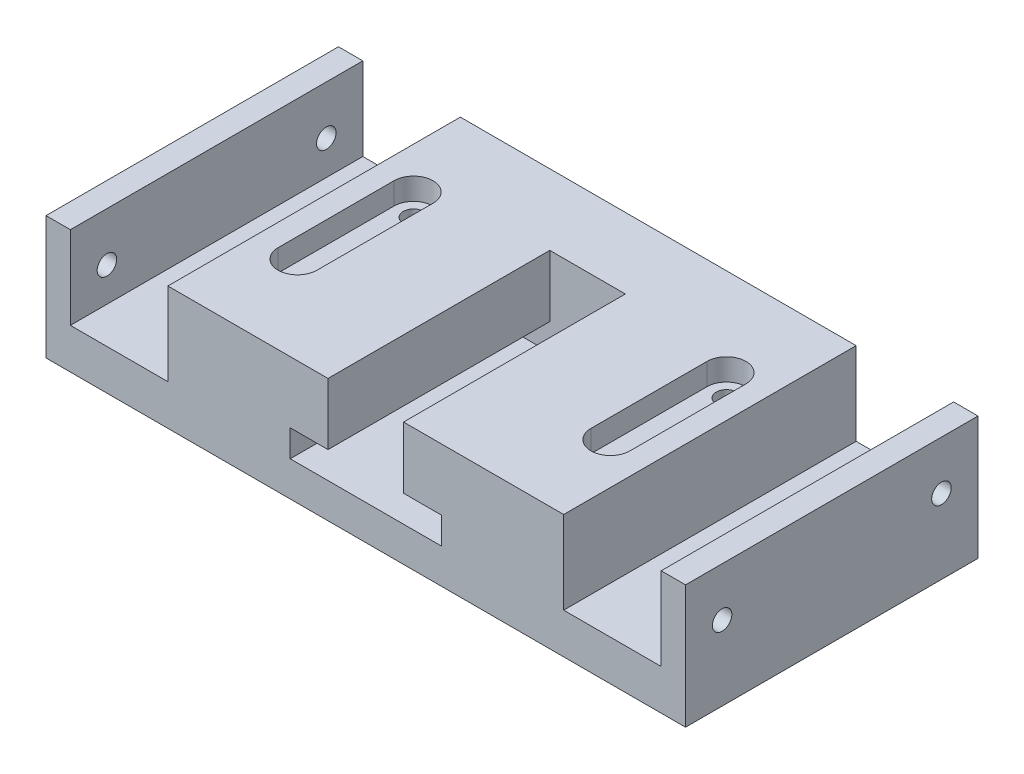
ISO-10303-21;
HEADER;
FILE_DESCRIPTION(('STEP AP214'),'2;1');
FILE_NAME('part.step','',(''),(''),'','','');
FILE_SCHEMA(('AUTOMOTIVE_DESIGN { 1 0 10303 214 1 1 1 1 }'));
ENDSEC;
DATA;
#1=APPLICATION_CONTEXT('core data for automotive mechanical design processes');
#2=APPLICATION_PROTOCOL_DEFINITION('international standard','automotive_design',2000,#1);
#3=PRODUCT_CONTEXT('',#1,'mechanical');
#4=PRODUCT('Part','Part','',(#3));
#5=PRODUCT_RELATED_PRODUCT_CATEGORY('part','',(#4));
#6=PRODUCT_DEFINITION_FORMATION('','',#4);
#7=PRODUCT_DEFINITION_CONTEXT('part definition',#1,'design');
#8=PRODUCT_DEFINITION('design','',#6,#7);
#9=PRODUCT_DEFINITION_SHAPE('','',#8);
#10=(LENGTH_UNIT() NAMED_UNIT(*) SI_UNIT(.MILLI.,.METRE.));
#11=(NAMED_UNIT(*) PLANE_ANGLE_UNIT() SI_UNIT($,.RADIAN.));
#12=(NAMED_UNIT(*) SI_UNIT($,.STERADIAN.) SOLID_ANGLE_UNIT());
#13=UNCERTAINTY_MEASURE_WITH_UNIT(LENGTH_MEASURE(1.E-05),#10,'distance_accuracy_value','');
#14=(GEOMETRIC_REPRESENTATION_CONTEXT(3) GLOBAL_UNCERTAINTY_ASSIGNED_CONTEXT((#13)) GLOBAL_UNIT_ASSIGNED_CONTEXT((#10,
#11,#12)) REPRESENTATION_CONTEXT('',''));
#15=CARTESIAN_POINT('',(0.,0.,0.));
#16=DIRECTION('',(0.,0.,1.));
#17=DIRECTION('',(1.,0.,0.));
#18=AXIS2_PLACEMENT_3D('',#15,#16,#17);
#19=CARTESIAN_POINT('',(-65.6,12.65,60.));
#20=DIRECTION('',(0.,-1.,0.));
#21=DIRECTION('',(0.,0.,-1.));
#22=AXIS2_PLACEMENT_3D('',#19,#20,#21);
#23=PLANE('',#22);
#24=DIRECTION('',(0.,0.,-1.));
#25=VECTOR('',#24,1.);
#26=CARTESIAN_POINT('',(-28.1,12.65,41.9));
#27=LINE('',#26,#25);
#28=CARTESIAN_POINT('',(-28.1,12.65,41.9));
#29=VERTEX_POINT('',#28);
#30=CARTESIAN_POINT('',(-28.1,12.65,18.1));
#31=VERTEX_POINT('',#30);
#32=EDGE_CURVE('E547',#29,#31,#27,.T.);
#33=ORIENTED_EDGE('',*,*,#32,.F.);
#34=CARTESIAN_POINT('',(-32.1,12.65,41.9));
#35=DIRECTION('',(0.,1.,0.));
#36=DIRECTION('',(0.,0.,1.));
#37=AXIS2_PLACEMENT_3D('',#34,#35,#36);
#38=CIRCLE('',#37,4.);
#39=CARTESIAN_POINT('',(-36.1,12.65,41.9));
#40=VERTEX_POINT('',#39);
#41=EDGE_CURVE('E372',#40,#29,#38,.T.);
#42=ORIENTED_EDGE('',*,*,#41,.F.);
#43=DIRECTION('',(0.,0.,1.));
#44=VECTOR('',#43,1.);
#45=CARTESIAN_POINT('',(-36.1,12.65,18.1));
#46=LINE('',#45,#44);
#47=CARTESIAN_POINT('',(-36.1,12.65,18.1));
#48=VERTEX_POINT('',#47);
#49=EDGE_CURVE('E331',#48,#40,#46,.T.);
#50=ORIENTED_EDGE('',*,*,#49,.F.);
#51=CARTESIAN_POINT('',(-32.1,12.65,18.1));
#52=DIRECTION('',(0.,1.,0.));
#53=DIRECTION('',(0.,0.,1.));
#54=AXIS2_PLACEMENT_3D('',#51,#52,#53);
#55=CIRCLE('',#54,4.);
#56=EDGE_CURVE('E550',#31,#48,#55,.T.);
#57=ORIENTED_EDGE('',*,*,#56,.F.);
#58=EDGE_LOOP('',(#33,#42,#50,#57));
#59=FACE_BOUND('',#58,.T.);
#60=DIRECTION('',(0.,0.,1.));
#61=VECTOR('',#60,1.);
#62=CARTESIAN_POINT('',(28.1,12.65,41.9));
#63=LINE('',#62,#61);
#64=CARTESIAN_POINT('',(28.1,12.65,18.1));
#65=VERTEX_POINT('',#64);
#66=CARTESIAN_POINT('',(28.1,12.65,41.9));
#67=VERTEX_POINT('',#66);
#68=EDGE_CURVE('E365',#65,#67,#63,.T.);
#69=ORIENTED_EDGE('',*,*,#68,.F.);
#70=CARTESIAN_POINT('',(32.1,12.65,18.1));
#71=DIRECTION('',(0.,1.,0.));
#72=DIRECTION('',(0.,0.,-1.));
#73=AXIS2_PLACEMENT_3D('',#70,#71,#72);
#74=CIRCLE('',#73,4.);
#75=CARTESIAN_POINT('',(36.1,12.65,18.1));
#76=VERTEX_POINT('',#75);
#77=EDGE_CURVE('E369',#76,#65,#74,.T.);
#78=ORIENTED_EDGE('',*,*,#77,.F.);
#79=DIRECTION('',(0.,0.,-1.));
#80=VECTOR('',#79,1.);
#81=CARTESIAN_POINT('',(36.1,12.65,18.1));
#82=LINE('',#81,#80);
#83=CARTESIAN_POINT('',(36.1,12.65,41.9));
#84=VERTEX_POINT('',#83);
#85=EDGE_CURVE('E356',#84,#76,#82,.T.);
#86=ORIENTED_EDGE('',*,*,#85,.F.);
#87=CARTESIAN_POINT('',(32.1,12.65,41.9));
#88=DIRECTION('',(0.,1.,0.));
#89=DIRECTION('',(0.,0.,-1.));
#90=AXIS2_PLACEMENT_3D('',#87,#88,#89);
#91=CIRCLE('',#90,4.);
#92=EDGE_CURVE('E360',#67,#84,#91,.T.);
#93=ORIENTED_EDGE('',*,*,#92,.F.);
#94=EDGE_LOOP('',(#69,#78,#86,#93));
#95=FACE_BOUND('',#94,.T.);
#96=DIRECTION('',(-1.,0.,0.));
#97=VECTOR('',#96,1.);
#98=CARTESIAN_POINT('',(-65.6,12.65,0.));
#99=LINE('',#98,#97);
#100=CARTESIAN_POINT('',(40.6,12.65,0.));
#101=VERTEX_POINT('',#100);
#102=CARTESIAN_POINT('',(-40.6,12.65,0.));
#103=VERTEX_POINT('',#102);
#104=EDGE_CURVE('E256',#101,#103,#99,.T.);
#105=ORIENTED_EDGE('',*,*,#104,.T.);
#106=DIRECTION('',(0.,0.,1.));
#107=VECTOR('',#106,1.);
#108=CARTESIAN_POINT('',(-40.6,12.65,0.));
#109=LINE('',#108,#107);
#110=CARTESIAN_POINT('',(-40.6,12.65,60.));
#111=VERTEX_POINT('',#110);
#112=EDGE_CURVE('E355',#103,#111,#109,.T.);
#113=ORIENTED_EDGE('',*,*,#112,.T.);
#114=DIRECTION('',(-1.,0.,0.));
#115=VECTOR('',#114,1.);
#116=CARTESIAN_POINT('',(-65.6,12.65,60.));
#117=LINE('',#116,#115);
#118=CARTESIAN_POINT('',(-7.75,12.65,60.));
#119=VERTEX_POINT('',#118);
#120=EDGE_CURVE('E482',#119,#111,#117,.T.);
#121=ORIENTED_EDGE('',*,*,#120,.F.);
#122=DIRECTION('',(0.,0.,1.));
#123=VECTOR('',#122,1.);
#124=CARTESIAN_POINT('',(-7.75,12.65,14.5));
#125=LINE('',#124,#123);
#126=CARTESIAN_POINT('',(-7.75,12.65,14.5));
#127=VERTEX_POINT('',#126);
#128=EDGE_CURVE('E265',#127,#119,#125,.T.);
#129=ORIENTED_EDGE('',*,*,#128,.F.);
#130=DIRECTION('',(-1.,0.,0.));
#131=VECTOR('',#130,1.);
#132=CARTESIAN_POINT('',(7.75,12.65,14.5));
#133=LINE('',#132,#131);
#134=CARTESIAN_POINT('',(7.75,12.65,14.5));
#135=VERTEX_POINT('',#134);
#136=EDGE_CURVE('E419',#135,#127,#133,.T.);
#137=ORIENTED_EDGE('',*,*,#136,.F.);
#138=DIRECTION('',(0.,0.,1.));
#139=VECTOR('',#138,1.);
#140=CARTESIAN_POINT('',(7.75,12.65,14.5));
#141=LINE('',#140,#139);
#142=CARTESIAN_POINT('',(7.75,12.65,60.));
#143=VERTEX_POINT('',#142);
#144=EDGE_CURVE('E451',#135,#143,#141,.T.);
#145=ORIENTED_EDGE('',*,*,#144,.T.);
#146=CARTESIAN_POINT('',(40.6,12.65,60.));
#147=VERTEX_POINT('',#146);
#148=EDGE_CURVE('E481',#147,#143,#117,.T.);
#149=ORIENTED_EDGE('',*,*,#148,.F.);
#150=DIRECTION('',(0.,0.,1.));
#151=VECTOR('',#150,1.);
#152=CARTESIAN_POINT('',(40.6,12.65,0.));
#153=LINE('',#152,#151);
#154=EDGE_CURVE('E674',#101,#147,#153,.T.);
#155=ORIENTED_EDGE('',*,*,#154,.F.);
#156=EDGE_LOOP('',(#105,#113,#121,#129,#137,#145,#149,#155));
#157=FACE_BOUND('',#156,.T.);
#158=ADVANCED_FACE('F41',(#59,#95,#157),#23,.F.);
#159=CARTESIAN_POINT('',(-60.6,12.65,60.));
#160=VERTEX_POINT('',#159);
#161=CARTESIAN_POINT('',(-65.6,12.65,60.));
#162=VERTEX_POINT('',#161);
#163=EDGE_CURVE('E247',#160,#162,#117,.T.);
#164=ORIENTED_EDGE('',*,*,#163,.F.);
#165=DIRECTION('',(0.,0.,1.));
#166=VECTOR('',#165,1.);
#167=CARTESIAN_POINT('',(-60.6,12.65,0.));
#168=LINE('',#167,#166);
#169=CARTESIAN_POINT('',(-60.6,12.65,0.));
#170=VERTEX_POINT('',#169);
#171=EDGE_CURVE('E233',#170,#160,#168,.T.);
#172=ORIENTED_EDGE('',*,*,#171,.F.);
#173=CARTESIAN_POINT('',(-65.6,12.65,0.));
#174=VERTEX_POINT('',#173);
#175=EDGE_CURVE('E245',#170,#174,#99,.T.);
#176=ORIENTED_EDGE('',*,*,#175,.T.);
#177=DIRECTION('',(0.,0.,-1.));
#178=VECTOR('',#177,1.);
#179=CARTESIAN_POINT('',(-65.6,12.65,60.));
#180=LINE('',#179,#178);
#181=EDGE_CURVE('E51',#162,#174,#180,.T.);
#182=ORIENTED_EDGE('',*,*,#181,.F.);
#183=EDGE_LOOP('',(#164,#172,#176,#182));
#184=FACE_BOUND('',#183,.T.);
#185=ADVANCED_FACE('F243',(#184),#23,.F.);
#186=CARTESIAN_POINT('',(-32.1,-32.85,18.1));
#187=DIRECTION('',(0.,1.,0.));
#188=DIRECTION('',(0.,0.,1.));
#189=AXIS2_PLACEMENT_3D('',#186,#187,#188);
#190=CYLINDRICAL_SURFACE('',#189,2.1);
#191=CARTESIAN_POINT('',(-32.1,-12.65,18.1));
#192=DIRECTION('',(0.,1.,0.));
#193=DIRECTION('',(0.,0.,1.));
#194=AXIS2_PLACEMENT_3D('',#191,#192,#193);
#195=CIRCLE('',#194,2.1);
#196=CARTESIAN_POINT('',(-32.1,-12.65,20.2));
#197=VERTEX_POINT('',#196);
#198=EDGE_CURVE('E292',#197,#197,#195,.T.);
#199=ORIENTED_EDGE('',*,*,#198,.F.);
#200=EDGE_LOOP('',(#199));
#201=FACE_BOUND('',#200,.T.);
#202=CARTESIAN_POINT('',(-32.1,8.15,18.1));
#203=DIRECTION('',(0.,1.,0.));
#204=DIRECTION('',(0.,0.,1.));
#205=AXIS2_PLACEMENT_3D('',#202,#203,#204);
#206=CIRCLE('',#205,2.1);
#207=CARTESIAN_POINT('',(-32.1,8.15,20.2));
#208=VERTEX_POINT('',#207);
#209=EDGE_CURVE('E297',#208,#208,#206,.F.);
#210=ORIENTED_EDGE('',*,*,#209,.F.);
#211=EDGE_LOOP('',(#210));
#212=FACE_BOUND('',#211,.T.);
#213=ADVANCED_FACE('F589',(#201,#212),#190,.F.);
#214=CARTESIAN_POINT('',(-32.1,-32.85,41.9));
#215=DIRECTION('',(0.,1.,0.));
#216=DIRECTION('',(0.,0.,1.));
#217=AXIS2_PLACEMENT_3D('',#214,#215,#216);
#218=CYLINDRICAL_SURFACE('',#217,2.1);
#219=CARTESIAN_POINT('',(-32.1,-12.65,41.9));
#220=DIRECTION('',(0.,1.,0.));
#221=DIRECTION('',(0.,0.,1.));
#222=AXIS2_PLACEMENT_3D('',#219,#220,#221);
#223=CIRCLE('',#222,2.1);
#224=CARTESIAN_POINT('',(-32.1,-12.65,44.));
#225=VERTEX_POINT('',#224);
#226=EDGE_CURVE('E301',#225,#225,#223,.T.);
#227=ORIENTED_EDGE('',*,*,#226,.F.);
#228=EDGE_LOOP('',(#227));
#229=FACE_BOUND('',#228,.T.);
#230=CARTESIAN_POINT('',(-32.1,8.15,41.9));
#231=DIRECTION('',(0.,1.,0.));
#232=DIRECTION('',(0.,0.,1.));
#233=AXIS2_PLACEMENT_3D('',#230,#231,#232);
#234=CIRCLE('',#233,2.1);
#235=CARTESIAN_POINT('',(-32.1,8.15,44.));
#236=VERTEX_POINT('',#235);
#237=EDGE_CURVE('E45',#236,#236,#234,.F.);
#238=ORIENTED_EDGE('',*,*,#237,.F.);
#239=EDGE_LOOP('',(#238));
#240=FACE_BOUND('',#239,.T.);
#241=ADVANCED_FACE('F599',(#229,#240),#218,.F.);
#242=CARTESIAN_POINT('',(65.6,12.65,60.));
#243=DIRECTION('',(-1.,0.,0.));
#244=DIRECTION('',(0.,0.,1.));
#245=AXIS2_PLACEMENT_3D('',#242,#243,#244);
#246=PLANE('',#245);
#247=CARTESIAN_POINT('',(65.6,2.65000000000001,7.5));
#248=DIRECTION('',(1.,0.,0.));
#249=DIRECTION('',(0.,0.,-1.));
#250=AXIS2_PLACEMENT_3D('',#247,#248,#249);
#251=CIRCLE('',#250,2.);
#252=CARTESIAN_POINT('',(65.6,2.65000000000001,5.5));
#253=VERTEX_POINT('',#252);
#254=EDGE_CURVE('E611',#253,#253,#251,.T.);
#255=ORIENTED_EDGE('',*,*,#254,.F.);
#256=EDGE_LOOP('',(#255));
#257=FACE_BOUND('',#256,.T.);
#258=CARTESIAN_POINT('',(65.6,2.65000000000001,52.5));
#259=DIRECTION('',(1.,0.,0.));
#260=DIRECTION('',(0.,0.,1.));
#261=AXIS2_PLACEMENT_3D('',#258,#259,#260);
#262=CIRCLE('',#261,2.);
#263=CARTESIAN_POINT('',(65.6,2.65000000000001,54.5));
#264=VERTEX_POINT('',#263);
#265=EDGE_CURVE('E614',#264,#264,#262,.T.);
#266=ORIENTED_EDGE('',*,*,#265,.F.);
#267=EDGE_LOOP('',(#266));
#268=FACE_BOUND('',#267,.T.);
#269=DIRECTION('',(0.,1.,0.));
#270=VECTOR('',#269,1.);
#271=CARTESIAN_POINT('',(65.6,12.65,0.));
#272=LINE('',#271,#270);
#273=CARTESIAN_POINT('',(65.6,-12.65,0.));
#274=VERTEX_POINT('',#273);
#275=CARTESIAN_POINT('',(65.6,12.65,0.));
#276=VERTEX_POINT('',#275);
#277=EDGE_CURVE('E257',#274,#276,#272,.T.);
#278=ORIENTED_EDGE('',*,*,#277,.T.);
#279=DIRECTION('',(0.,0.,-1.));
#280=VECTOR('',#279,1.);
#281=CARTESIAN_POINT('',(65.6,12.65,60.));
#282=LINE('',#281,#280);
#283=CARTESIAN_POINT('',(65.6,12.65,60.));
#284=VERTEX_POINT('',#283);
#285=EDGE_CURVE('E11',#284,#276,#282,.T.);
#286=ORIENTED_EDGE('',*,*,#285,.F.);
#287=DIRECTION('',(0.,1.,0.));
#288=VECTOR('',#287,1.);
#289=CARTESIAN_POINT('',(65.6,12.65,60.));
#290=LINE('',#289,#288);
#291=CARTESIAN_POINT('',(65.6,-12.65,60.));
#292=VERTEX_POINT('',#291);
#293=EDGE_CURVE('E279',#292,#284,#290,.T.);
#294=ORIENTED_EDGE('',*,*,#293,.F.);
#295=DIRECTION('',(0.,0.,-1.));
#296=VECTOR('',#295,1.);
#297=CARTESIAN_POINT('',(65.6,-12.65,60.));
#298=LINE('',#297,#296);
#299=EDGE_CURVE('E282',#292,#274,#298,.T.);
#300=ORIENTED_EDGE('',*,*,#299,.T.);
#301=EDGE_LOOP('',(#278,#286,#294,#300));
#302=FACE_BOUND('',#301,.T.);
#303=ADVANCED_FACE('F43',(#257,#268,#302),#246,.F.);
#304=CARTESIAN_POINT('',(60.6,12.65,0.));
#305=VERTEX_POINT('',#304);
#306=EDGE_CURVE('E259',#276,#305,#99,.T.);
#307=ORIENTED_EDGE('',*,*,#306,.T.);
#308=DIRECTION('',(0.,0.,1.));
#309=VECTOR('',#308,1.);
#310=CARTESIAN_POINT('',(60.6,12.65,0.));
#311=LINE('',#310,#309);
#312=CARTESIAN_POINT('',(60.6,12.65,60.));
#313=VERTEX_POINT('',#312);
#314=EDGE_CURVE('E67',#305,#313,#311,.T.);
#315=ORIENTED_EDGE('',*,*,#314,.T.);
#316=EDGE_CURVE('E476',#284,#313,#117,.T.);
#317=ORIENTED_EDGE('',*,*,#316,.F.);
#318=ORIENTED_EDGE('',*,*,#285,.T.);
#319=EDGE_LOOP('',(#307,#315,#317,#318));
#320=FACE_BOUND('',#319,.T.);
#321=ADVANCED_FACE('F499',(#320),#23,.F.);
#322=CARTESIAN_POINT('',(-65.6,12.65,60.));
#323=DIRECTION('',(1.,0.,0.));
#324=DIRECTION('',(0.,0.,-1.));
#325=AXIS2_PLACEMENT_3D('',#322,#323,#324);
#326=PLANE('',#325);
#327=CARTESIAN_POINT('',(-65.6,2.65,52.5));
#328=DIRECTION('',(-1.,0.,0.));
#329=DIRECTION('',(0.,0.,1.));
#330=AXIS2_PLACEMENT_3D('',#327,#328,#329);
#331=CIRCLE('',#330,2.);
#332=CARTESIAN_POINT('',(-65.6,2.65,54.5));
#333=VERTEX_POINT('',#332);
#334=EDGE_CURVE('E636',#333,#333,#331,.T.);
#335=ORIENTED_EDGE('',*,*,#334,.F.);
#336=EDGE_LOOP('',(#335));
#337=FACE_BOUND('',#336,.T.);
#338=CARTESIAN_POINT('',(-65.6,2.65,7.5));
#339=DIRECTION('',(-1.,0.,0.));
#340=DIRECTION('',(0.,0.,-1.));
#341=AXIS2_PLACEMENT_3D('',#338,#339,#340);
#342=CIRCLE('',#341,2.);
#343=CARTESIAN_POINT('',(-65.6,2.65,5.5));
#344=VERTEX_POINT('',#343);
#345=EDGE_CURVE('E642',#344,#344,#342,.T.);
#346=ORIENTED_EDGE('',*,*,#345,.F.);
#347=EDGE_LOOP('',(#346));
#348=FACE_BOUND('',#347,.T.);
#349=DIRECTION('',(0.,-1.,0.));
#350=VECTOR('',#349,1.);
#351=CARTESIAN_POINT('',(-65.6,12.65,0.));
#352=LINE('',#351,#350);
#353=CARTESIAN_POINT('',(-65.6,-12.65,0.));
#354=VERTEX_POINT('',#353);
#355=EDGE_CURVE('E254',#174,#354,#352,.T.);
#356=ORIENTED_EDGE('',*,*,#355,.T.);
#357=DIRECTION('',(0.,0.,-1.));
#358=VECTOR('',#357,1.);
#359=CARTESIAN_POINT('',(-65.6,-12.65,60.));
#360=LINE('',#359,#358);
#361=CARTESIAN_POINT('',(-65.6,-12.65,60.));
#362=VERTEX_POINT('',#361);
#363=EDGE_CURVE('E286',#362,#354,#360,.T.);
#364=ORIENTED_EDGE('',*,*,#363,.F.);
#365=DIRECTION('',(0.,-1.,0.));
#366=VECTOR('',#365,1.);
#367=CARTESIAN_POINT('',(-65.6,12.65,60.));
#368=LINE('',#367,#366);
#369=EDGE_CURVE('E480',#162,#362,#368,.T.);
#370=ORIENTED_EDGE('',*,*,#369,.F.);
#371=ORIENTED_EDGE('',*,*,#181,.T.);
#372=EDGE_LOOP('',(#356,#364,#370,#371));
#373=FACE_BOUND('',#372,.T.);
#374=ADVANCED_FACE('F592',(#337,#348,#373),#326,.F.);
#375=CARTESIAN_POINT('',(-65.6,-12.65,60.));
#376=DIRECTION('',(0.,1.,0.));
#377=DIRECTION('',(0.,0.,1.));
#378=AXIS2_PLACEMENT_3D('',#375,#376,#377);
#379=PLANE('',#378);
#380=CARTESIAN_POINT('',(-32.1,-12.65,47.9));
#381=DIRECTION('',(0.,-1.,0.));
#382=DIRECTION('',(0.,0.,-1.));
#383=AXIS2_PLACEMENT_3D('',#380,#381,#382);
#384=CIRCLE('',#383,3.5);
#385=CARTESIAN_POINT('',(-32.1,-12.65,44.4));
#386=VERTEX_POINT('',#385);
#387=EDGE_CURVE('E792',#386,#386,#384,.T.);
#388=ORIENTED_EDGE('',*,*,#387,.F.);
#389=EDGE_LOOP('',(#388));
#390=FACE_BOUND('',#389,.T.);
#391=CARTESIAN_POINT('',(32.1,-12.65,10.6));
#392=DIRECTION('',(0.,-1.,0.));
#393=DIRECTION('',(0.,0.,1.));
#394=AXIS2_PLACEMENT_3D('',#391,#392,#393);
#395=CIRCLE('',#394,3.5);
#396=CARTESIAN_POINT('',(32.1,-12.65,14.1));
#397=VERTEX_POINT('',#396);
#398=EDGE_CURVE('E796',#397,#397,#395,.T.);
#399=ORIENTED_EDGE('',*,*,#398,.F.);
#400=EDGE_LOOP('',(#399));
#401=FACE_BOUND('',#400,.T.);
#402=CARTESIAN_POINT('',(32.1,-12.65,49.4));
#403=DIRECTION('',(0.,-1.,0.));
#404=DIRECTION('',(0.,0.,-1.));
#405=AXIS2_PLACEMENT_3D('',#402,#403,#404);
#406=CIRCLE('',#405,3.5);
#407=CARTESIAN_POINT('',(32.1,-12.65,45.9));
#408=VERTEX_POINT('',#407);
#409=EDGE_CURVE('E800',#408,#408,#406,.T.);
#410=ORIENTED_EDGE('',*,*,#409,.F.);
#411=EDGE_LOOP('',(#410));
#412=FACE_BOUND('',#411,.T.);
#413=CARTESIAN_POINT('',(-32.1,-12.65,10.6));
#414=DIRECTION('',(0.,-1.,0.));
#415=DIRECTION('',(0.,0.,-1.));
#416=AXIS2_PLACEMENT_3D('',#413,#414,#415);
#417=CIRCLE('',#416,3.5);
#418=CARTESIAN_POINT('',(-32.1,-12.65,7.1));
#419=VERTEX_POINT('',#418);
#420=EDGE_CURVE('E626',#419,#419,#417,.T.);
#421=ORIENTED_EDGE('',*,*,#420,.F.);
#422=EDGE_LOOP('',(#421));
#423=FACE_BOUND('',#422,.T.);
#424=CARTESIAN_POINT('',(32.1,-12.65,18.1));
#425=DIRECTION('',(0.,1.,0.));
#426=DIRECTION('',(0.,0.,1.));
#427=AXIS2_PLACEMENT_3D('',#424,#425,#426);
#428=CIRCLE('',#427,2.1);
#429=CARTESIAN_POINT('',(32.1,-12.65,20.2));
#430=VERTEX_POINT('',#429);
#431=EDGE_CURVE('E305',#430,#430,#428,.T.);
#432=ORIENTED_EDGE('',*,*,#431,.T.);
#433=EDGE_LOOP('',(#432));
#434=FACE_BOUND('',#433,.T.);
#435=ORIENTED_EDGE('',*,*,#226,.T.);
#436=EDGE_LOOP('',(#435));
#437=FACE_BOUND('',#436,.T.);
#438=CARTESIAN_POINT('',(32.1,-12.65,41.9));
#439=DIRECTION('',(0.,1.,0.));
#440=DIRECTION('',(0.,0.,1.));
#441=AXIS2_PLACEMENT_3D('',#438,#439,#440);
#442=CIRCLE('',#441,2.1);
#443=CARTESIAN_POINT('',(32.1,-12.65,44.));
#444=VERTEX_POINT('',#443);
#445=EDGE_CURVE('E296',#444,#444,#442,.T.);
#446=ORIENTED_EDGE('',*,*,#445,.T.);
#447=EDGE_LOOP('',(#446));
#448=FACE_BOUND('',#447,.T.);
#449=ORIENTED_EDGE('',*,*,#198,.T.);
#450=EDGE_LOOP('',(#449));
#451=FACE_BOUND('',#450,.T.);
#452=DIRECTION('',(1.,0.,0.));
#453=VECTOR('',#452,1.);
#454=CARTESIAN_POINT('',(-65.6,-12.65,0.));
#455=LINE('',#454,#453);
#456=EDGE_CURVE('E273',#354,#274,#455,.T.);
#457=ORIENTED_EDGE('',*,*,#456,.T.);
#458=ORIENTED_EDGE('',*,*,#299,.F.);
#459=DIRECTION('',(1.,0.,0.));
#460=VECTOR('',#459,1.);
#461=CARTESIAN_POINT('',(-65.6,-12.65,60.));
#462=LINE('',#461,#460);
#463=EDGE_CURVE('E287',#362,#292,#462,.T.);
#464=ORIENTED_EDGE('',*,*,#463,.F.);
#465=ORIENTED_EDGE('',*,*,#363,.T.);
#466=EDGE_LOOP('',(#457,#458,#464,#465));
#467=FACE_BOUND('',#466,.T.);
#468=ADVANCED_FACE('F496',(#390,#401,#412,#423,#434,#437,#448,#451,#467),#379,.F.);
#469=CARTESIAN_POINT('',(0.,0.,60.));
#470=DIRECTION('',(0.,0.,1.));
#471=DIRECTION('',(1.,0.,0.));
#472=AXIS2_PLACEMENT_3D('',#469,#470,#471);
#473=PLANE('',#472);
#474=DIRECTION('',(0.,1.,0.));
#475=VECTOR('',#474,1.);
#476=CARTESIAN_POINT('',(-40.6,-4.34999999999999,60.));
#477=LINE('',#476,#475);
#478=CARTESIAN_POINT('',(-40.6,-4.34999999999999,60.));
#479=VERTEX_POINT('',#478);
#480=EDGE_CURVE('E239',#479,#111,#477,.T.);
#481=ORIENTED_EDGE('',*,*,#480,.F.);
#482=DIRECTION('',(1.,0.,0.));
#483=VECTOR('',#482,1.);
#484=CARTESIAN_POINT('',(-60.6,-4.34999999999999,60.));
#485=LINE('',#484,#483);
#486=CARTESIAN_POINT('',(-60.6,-4.34999999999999,60.));
#487=VERTEX_POINT('',#486);
#488=EDGE_CURVE('E656',#487,#479,#485,.T.);
#489=ORIENTED_EDGE('',*,*,#488,.F.);
#490=DIRECTION('',(0.,-1.,0.));
#491=VECTOR('',#490,1.);
#492=CARTESIAN_POINT('',(-60.6,12.65,60.));
#493=LINE('',#492,#491);
#494=EDGE_CURVE('E512',#160,#487,#493,.T.);
#495=ORIENTED_EDGE('',*,*,#494,.F.);
#496=ORIENTED_EDGE('',*,*,#163,.T.);
#497=ORIENTED_EDGE('',*,*,#369,.T.);
#498=ORIENTED_EDGE('',*,*,#463,.T.);
#499=ORIENTED_EDGE('',*,*,#293,.T.);
#500=ORIENTED_EDGE('',*,*,#316,.T.);
#501=DIRECTION('',(0.,1.,0.));
#502=VECTOR('',#501,1.);
#503=CARTESIAN_POINT('',(60.6,12.65,60.));
#504=LINE('',#503,#502);
#505=CARTESIAN_POINT('',(60.6,-4.34999999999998,60.));
#506=VERTEX_POINT('',#505);
#507=EDGE_CURVE('E502',#506,#313,#504,.T.);
#508=ORIENTED_EDGE('',*,*,#507,.F.);
#509=DIRECTION('',(1.,0.,0.));
#510=VECTOR('',#509,1.);
#511=CARTESIAN_POINT('',(60.6,-4.34999999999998,60.));
#512=LINE('',#511,#510);
#513=CARTESIAN_POINT('',(40.6,-4.34999999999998,60.));
#514=VERTEX_POINT('',#513);
#515=EDGE_CURVE('E505',#514,#506,#512,.T.);
#516=ORIENTED_EDGE('',*,*,#515,.F.);
#517=DIRECTION('',(0.,-1.,0.));
#518=VECTOR('',#517,1.);
#519=CARTESIAN_POINT('',(40.6,-4.34999999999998,60.));
#520=LINE('',#519,#518);
#521=EDGE_CURVE('E507',#147,#514,#520,.T.);
#522=ORIENTED_EDGE('',*,*,#521,.F.);
#523=ORIENTED_EDGE('',*,*,#148,.T.);
#524=DIRECTION('',(0.,1.,0.));
#525=VECTOR('',#524,1.);
#526=CARTESIAN_POINT('',(7.75,12.65,60.));
#527=LINE('',#526,#525);
#528=CARTESIAN_POINT('',(7.75,0.,60.));
#529=VERTEX_POINT('',#528);
#530=EDGE_CURVE('E395',#529,#143,#527,.T.);
#531=ORIENTED_EDGE('',*,*,#530,.F.);
#532=DIRECTION('',(-1.,0.,0.));
#533=VECTOR('',#532,1.);
#534=CARTESIAN_POINT('',(15.5,0.,60.));
#535=LINE('',#534,#533);
#536=CARTESIAN_POINT('',(15.5,0.,60.));
#537=VERTEX_POINT('',#536);
#538=EDGE_CURVE('E442',#537,#529,#535,.T.);
#539=ORIENTED_EDGE('',*,*,#538,.F.);
#540=DIRECTION('',(0.,1.,0.));
#541=VECTOR('',#540,1.);
#542=CARTESIAN_POINT('',(15.5,-5.49999999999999,60.));
#543=LINE('',#542,#541);
#544=CARTESIAN_POINT('',(15.5,-5.49999999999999,60.));
#545=VERTEX_POINT('',#544);
#546=EDGE_CURVE('E438',#545,#537,#543,.T.);
#547=ORIENTED_EDGE('',*,*,#546,.F.);
#548=DIRECTION('',(1.,0.,0.));
#549=VECTOR('',#548,1.);
#550=CARTESIAN_POINT('',(15.5,-5.49999999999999,60.));
#551=LINE('',#550,#549);
#552=CARTESIAN_POINT('',(-15.5,-5.49999999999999,60.));
#553=VERTEX_POINT('',#552);
#554=EDGE_CURVE('E434',#553,#545,#551,.T.);
#555=ORIENTED_EDGE('',*,*,#554,.F.);
#556=DIRECTION('',(0.,-1.,0.));
#557=VECTOR('',#556,1.);
#558=CARTESIAN_POINT('',(-15.5,-5.49999999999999,60.));
#559=LINE('',#558,#557);
#560=CARTESIAN_POINT('',(-15.5,0.,60.));
#561=VERTEX_POINT('',#560);
#562=EDGE_CURVE('E430',#561,#553,#559,.T.);
#563=ORIENTED_EDGE('',*,*,#562,.F.);
#564=DIRECTION('',(-1.,0.,0.));
#565=VECTOR('',#564,1.);
#566=CARTESIAN_POINT('',(-15.5,0.,60.));
#567=LINE('',#566,#565);
#568=CARTESIAN_POINT('',(-7.75,0.,60.));
#569=VERTEX_POINT('',#568);
#570=EDGE_CURVE('E426',#569,#561,#567,.T.);
#571=ORIENTED_EDGE('',*,*,#570,.F.);
#572=DIRECTION('',(0.,-1.,0.));
#573=VECTOR('',#572,1.);
#574=CARTESIAN_POINT('',(-7.75,12.65,60.));
#575=LINE('',#574,#573);
#576=EDGE_CURVE('E308',#119,#569,#575,.T.);
#577=ORIENTED_EDGE('',*,*,#576,.F.);
#578=ORIENTED_EDGE('',*,*,#120,.T.);
#579=EDGE_LOOP('',(#481,#489,#495,#496,#497,#498,#499,#500,#508,#516,#522,#523,#531,#539,#547,
#555,#563,#571,#577,#578));
#580=FACE_BOUND('',#579,.T.);
#581=ADVANCED_FACE('F491',(#580),#473,.T.);
#582=CARTESIAN_POINT('',(0.,0.,0.));
#583=DIRECTION('',(0.,0.,1.));
#584=DIRECTION('',(1.,0.,0.));
#585=AXIS2_PLACEMENT_3D('',#582,#583,#584);
#586=PLANE('',#585);
#587=DIRECTION('',(1.,0.,0.));
#588=VECTOR('',#587,1.);
#589=CARTESIAN_POINT('',(-60.6,-4.34999999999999,0.));
#590=LINE('',#589,#588);
#591=CARTESIAN_POINT('',(-60.6,-4.34999999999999,0.));
#592=VERTEX_POINT('',#591);
#593=CARTESIAN_POINT('',(-40.6,-4.34999999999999,0.));
#594=VERTEX_POINT('',#593);
#595=EDGE_CURVE('E59',#592,#594,#590,.T.);
#596=ORIENTED_EDGE('',*,*,#595,.T.);
#597=DIRECTION('',(0.,1.,0.));
#598=VECTOR('',#597,1.);
#599=CARTESIAN_POINT('',(-40.6,-4.34999999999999,0.));
#600=LINE('',#599,#598);
#601=EDGE_CURVE('E249',#594,#103,#600,.T.);
#602=ORIENTED_EDGE('',*,*,#601,.T.);
#603=ORIENTED_EDGE('',*,*,#104,.F.);
#604=DIRECTION('',(0.,-1.,0.));
#605=VECTOR('',#604,1.);
#606=CARTESIAN_POINT('',(40.6,-4.34999999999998,0.));
#607=LINE('',#606,#605);
#608=CARTESIAN_POINT('',(40.6,-4.34999999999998,0.));
#609=VERTEX_POINT('',#608);
#610=EDGE_CURVE('E519',#101,#609,#607,.T.);
#611=ORIENTED_EDGE('',*,*,#610,.T.);
#612=DIRECTION('',(1.,0.,0.));
#613=VECTOR('',#612,1.);
#614=CARTESIAN_POINT('',(60.6,-4.34999999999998,0.));
#615=LINE('',#614,#613);
#616=CARTESIAN_POINT('',(60.6,-4.34999999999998,0.));
#617=VERTEX_POINT('',#616);
#618=EDGE_CURVE('E515',#609,#617,#615,.T.);
#619=ORIENTED_EDGE('',*,*,#618,.T.);
#620=DIRECTION('',(0.,1.,0.));
#621=VECTOR('',#620,1.);
#622=CARTESIAN_POINT('',(60.6,12.65,0.));
#623=LINE('',#622,#621);
#624=EDGE_CURVE('E523',#617,#305,#623,.T.);
#625=ORIENTED_EDGE('',*,*,#624,.T.);
#626=ORIENTED_EDGE('',*,*,#306,.F.);
#627=ORIENTED_EDGE('',*,*,#277,.F.);
#628=ORIENTED_EDGE('',*,*,#456,.F.);
#629=ORIENTED_EDGE('',*,*,#355,.F.);
#630=ORIENTED_EDGE('',*,*,#175,.F.);
#631=DIRECTION('',(0.,-1.,0.));
#632=VECTOR('',#631,1.);
#633=CARTESIAN_POINT('',(-60.6,12.65,0.));
#634=LINE('',#633,#632);
#635=EDGE_CURVE('E229',#170,#592,#634,.T.);
#636=ORIENTED_EDGE('',*,*,#635,.T.);
#637=EDGE_LOOP('',(#596,#602,#603,#611,#619,#625,#626,#627,#628,#629,#630,#636));
#638=FACE_BOUND('',#637,.T.);
#639=ADVANCED_FACE('F252',(#638),#586,.F.);
#640=CARTESIAN_POINT('',(-7.75,12.65,14.5));
#641=DIRECTION('',(-1.,0.,0.));
#642=DIRECTION('',(0.,-1.,0.));
#643=AXIS2_PLACEMENT_3D('',#640,#641,#642);
#644=PLANE('',#643);
#645=ORIENTED_EDGE('',*,*,#576,.T.);
#646=DIRECTION('',(0.,0.,1.));
#647=VECTOR('',#646,1.);
#648=CARTESIAN_POINT('',(-7.75,0.,14.5));
#649=LINE('',#648,#647);
#650=CARTESIAN_POINT('',(-7.75,0.,14.5));
#651=VERTEX_POINT('',#650);
#652=EDGE_CURVE('E423',#651,#569,#649,.T.);
#653=ORIENTED_EDGE('',*,*,#652,.F.);
#654=DIRECTION('',(0.,-1.,0.));
#655=VECTOR('',#654,1.);
#656=CARTESIAN_POINT('',(-7.75,12.65,14.5));
#657=LINE('',#656,#655);
#658=EDGE_CURVE('E390',#127,#651,#657,.T.);
#659=ORIENTED_EDGE('',*,*,#658,.F.);
#660=ORIENTED_EDGE('',*,*,#128,.T.);
#661=EDGE_LOOP('',(#645,#653,#659,#660));
#662=FACE_BOUND('',#661,.T.);
#663=ADVANCED_FACE('F757',(#662),#644,.F.);
#664=CARTESIAN_POINT('',(7.75,12.65,14.5));
#665=DIRECTION('',(1.,0.,0.));
#666=DIRECTION('',(0.,1.,0.));
#667=AXIS2_PLACEMENT_3D('',#664,#665,#666);
#668=PLANE('',#667);
#669=ORIENTED_EDGE('',*,*,#530,.T.);
#670=ORIENTED_EDGE('',*,*,#144,.F.);
#671=DIRECTION('',(0.,1.,0.));
#672=VECTOR('',#671,1.);
#673=CARTESIAN_POINT('',(7.75,12.65,14.5));
#674=LINE('',#673,#672);
#675=CARTESIAN_POINT('',(7.75,0.,14.5));
#676=VERTEX_POINT('',#675);
#677=EDGE_CURVE('E415',#676,#135,#674,.T.);
#678=ORIENTED_EDGE('',*,*,#677,.F.);
#679=DIRECTION('',(0.,0.,1.));
#680=VECTOR('',#679,1.);
#681=CARTESIAN_POINT('',(7.75,0.,14.5));
#682=LINE('',#681,#680);
#683=EDGE_CURVE('E455',#676,#529,#682,.T.);
#684=ORIENTED_EDGE('',*,*,#683,.T.);
#685=EDGE_LOOP('',(#669,#670,#678,#684));
#686=FACE_BOUND('',#685,.T.);
#687=ADVANCED_FACE('F753',(#686),#668,.F.);
#688=CARTESIAN_POINT('',(15.5,0.,14.5));
#689=DIRECTION('',(0.,1.,0.));
#690=DIRECTION('',(0.,0.,1.));
#691=AXIS2_PLACEMENT_3D('',#688,#689,#690);
#692=PLANE('',#691);
#693=ORIENTED_EDGE('',*,*,#538,.T.);
#694=ORIENTED_EDGE('',*,*,#683,.F.);
#695=DIRECTION('',(-1.,0.,0.));
#696=VECTOR('',#695,1.);
#697=CARTESIAN_POINT('',(15.5,0.,14.5));
#698=LINE('',#697,#696);
#699=CARTESIAN_POINT('',(15.5,0.,14.5));
#700=VERTEX_POINT('',#699);
#701=EDGE_CURVE('E411',#700,#676,#698,.T.);
#702=ORIENTED_EDGE('',*,*,#701,.F.);
#703=DIRECTION('',(0.,0.,1.));
#704=VECTOR('',#703,1.);
#705=CARTESIAN_POINT('',(15.5,0.,14.5));
#706=LINE('',#705,#704);
#707=EDGE_CURVE('E458',#700,#537,#706,.T.);
#708=ORIENTED_EDGE('',*,*,#707,.T.);
#709=EDGE_LOOP('',(#693,#694,#702,#708));
#710=FACE_BOUND('',#709,.T.);
#711=ADVANCED_FACE('F756',(#710),#692,.F.);
#712=CARTESIAN_POINT('',(15.5,-5.49999999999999,14.5));
#713=DIRECTION('',(1.,0.,0.));
#714=DIRECTION('',(0.,1.,0.));
#715=AXIS2_PLACEMENT_3D('',#712,#713,#714);
#716=PLANE('',#715);
#717=ORIENTED_EDGE('',*,*,#546,.T.);
#718=ORIENTED_EDGE('',*,*,#707,.F.);
#719=DIRECTION('',(0.,1.,0.));
#720=VECTOR('',#719,1.);
#721=CARTESIAN_POINT('',(15.5,-5.49999999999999,14.5));
#722=LINE('',#721,#720);
#723=CARTESIAN_POINT('',(15.5,-5.49999999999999,14.5));
#724=VERTEX_POINT('',#723);
#725=EDGE_CURVE('E407',#724,#700,#722,.T.);
#726=ORIENTED_EDGE('',*,*,#725,.F.);
#727=DIRECTION('',(0.,0.,1.));
#728=VECTOR('',#727,1.);
#729=CARTESIAN_POINT('',(15.5,-5.49999999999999,14.5));
#730=LINE('',#729,#728);
#731=EDGE_CURVE('E461',#724,#545,#730,.T.);
#732=ORIENTED_EDGE('',*,*,#731,.T.);
#733=EDGE_LOOP('',(#717,#718,#726,#732));
#734=FACE_BOUND('',#733,.T.);
#735=ADVANCED_FACE('F761',(#734),#716,.F.);
#736=CARTESIAN_POINT('',(15.5,-5.49999999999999,14.5));
#737=DIRECTION('',(0.,-1.,0.));
#738=DIRECTION('',(0.,0.,-1.));
#739=AXIS2_PLACEMENT_3D('',#736,#737,#738);
#740=PLANE('',#739);
#741=ORIENTED_EDGE('',*,*,#554,.T.);
#742=ORIENTED_EDGE('',*,*,#731,.F.);
#743=DIRECTION('',(1.,0.,0.));
#744=VECTOR('',#743,1.);
#745=CARTESIAN_POINT('',(15.5,-5.49999999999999,14.5));
#746=LINE('',#745,#744);
#747=CARTESIAN_POINT('',(-15.5,-5.49999999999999,14.5));
#748=VERTEX_POINT('',#747);
#749=EDGE_CURVE('E403',#748,#724,#746,.T.);
#750=ORIENTED_EDGE('',*,*,#749,.F.);
#751=DIRECTION('',(0.,0.,1.));
#752=VECTOR('',#751,1.);
#753=CARTESIAN_POINT('',(-15.5,-5.49999999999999,14.5));
#754=LINE('',#753,#752);
#755=EDGE_CURVE('E464',#748,#553,#754,.T.);
#756=ORIENTED_EDGE('',*,*,#755,.T.);
#757=EDGE_LOOP('',(#741,#742,#750,#756));
#758=FACE_BOUND('',#757,.T.);
#759=ADVANCED_FACE('F765',(#758),#740,.F.);
#760=CARTESIAN_POINT('',(-15.5,-5.49999999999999,14.5));
#761=DIRECTION('',(-1.,0.,0.));
#762=DIRECTION('',(0.,-1.,0.));
#763=AXIS2_PLACEMENT_3D('',#760,#761,#762);
#764=PLANE('',#763);
#765=ORIENTED_EDGE('',*,*,#562,.T.);
#766=ORIENTED_EDGE('',*,*,#755,.F.);
#767=DIRECTION('',(0.,-1.,0.));
#768=VECTOR('',#767,1.);
#769=CARTESIAN_POINT('',(-15.5,-5.49999999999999,14.5));
#770=LINE('',#769,#768);
#771=CARTESIAN_POINT('',(-15.5,0.,14.5));
#772=VERTEX_POINT('',#771);
#773=EDGE_CURVE('E399',#772,#748,#770,.T.);
#774=ORIENTED_EDGE('',*,*,#773,.F.);
#775=DIRECTION('',(0.,0.,1.));
#776=VECTOR('',#775,1.);
#777=CARTESIAN_POINT('',(-15.5,0.,14.5));
#778=LINE('',#777,#776);
#779=EDGE_CURVE('E467',#772,#561,#778,.T.);
#780=ORIENTED_EDGE('',*,*,#779,.T.);
#781=EDGE_LOOP('',(#765,#766,#774,#780));
#782=FACE_BOUND('',#781,.T.);
#783=ADVANCED_FACE('F769',(#782),#764,.F.);
#784=CARTESIAN_POINT('',(-15.5,0.,14.5));
#785=DIRECTION('',(0.,1.,0.));
#786=DIRECTION('',(0.,0.,1.));
#787=AXIS2_PLACEMENT_3D('',#784,#785,#786);
#788=PLANE('',#787);
#789=ORIENTED_EDGE('',*,*,#570,.T.);
#790=ORIENTED_EDGE('',*,*,#779,.F.);
#791=DIRECTION('',(-1.,0.,0.));
#792=VECTOR('',#791,1.);
#793=CARTESIAN_POINT('',(-15.5,0.,14.5));
#794=LINE('',#793,#792);
#795=EDGE_CURVE('E394',#651,#772,#794,.T.);
#796=ORIENTED_EDGE('',*,*,#795,.F.);
#797=ORIENTED_EDGE('',*,*,#652,.T.);
#798=EDGE_LOOP('',(#789,#790,#796,#797));
#799=FACE_BOUND('',#798,.T.);
#800=ADVANCED_FACE('F751',(#799),#788,.F.);
#801=CARTESIAN_POINT('',(0.,0.,14.5));
#802=DIRECTION('',(0.,0.,1.));
#803=DIRECTION('',(1.,0.,0.));
#804=AXIS2_PLACEMENT_3D('',#801,#802,#803);
#805=PLANE('',#804);
#806=ORIENTED_EDGE('',*,*,#658,.T.);
#807=ORIENTED_EDGE('',*,*,#795,.T.);
#808=ORIENTED_EDGE('',*,*,#773,.T.);
#809=ORIENTED_EDGE('',*,*,#749,.T.);
#810=ORIENTED_EDGE('',*,*,#725,.T.);
#811=ORIENTED_EDGE('',*,*,#701,.T.);
#812=ORIENTED_EDGE('',*,*,#677,.T.);
#813=ORIENTED_EDGE('',*,*,#136,.T.);
#814=EDGE_LOOP('',(#806,#807,#808,#809,#810,#811,#812,#813));
#815=FACE_BOUND('',#814,.T.);
#816=ADVANCED_FACE('F742',(#815),#805,.T.);
#817=CARTESIAN_POINT('',(32.1,-32.85,41.9));
#818=DIRECTION('',(0.,1.,0.));
#819=DIRECTION('',(0.,0.,1.));
#820=AXIS2_PLACEMENT_3D('',#817,#818,#819);
#821=CYLINDRICAL_SURFACE('',#820,2.1);
#822=CARTESIAN_POINT('',(32.1,8.15,41.9));
#823=DIRECTION('',(0.,-1.,0.));
#824=DIRECTION('',(0.,0.,-1.));
#825=AXIS2_PLACEMENT_3D('',#822,#823,#824);
#826=CIRCLE('',#825,2.1);
#827=CARTESIAN_POINT('',(32.1,8.15,39.8));
#828=VERTEX_POINT('',#827);
#829=EDGE_CURVE('E312',#828,#828,#826,.F.);
#830=ORIENTED_EDGE('',*,*,#829,.T.);
#831=EDGE_LOOP('',(#830));
#832=FACE_BOUND('',#831,.T.);
#833=ORIENTED_EDGE('',*,*,#445,.F.);
#834=EDGE_LOOP('',(#833));
#835=FACE_BOUND('',#834,.T.);
#836=ADVANCED_FACE('F739',(#832,#835),#821,.F.);
#837=CARTESIAN_POINT('',(32.1,-32.85,18.1));
#838=DIRECTION('',(0.,1.,0.));
#839=DIRECTION('',(0.,0.,1.));
#840=AXIS2_PLACEMENT_3D('',#837,#838,#839);
#841=CYLINDRICAL_SURFACE('',#840,2.1);
#842=CARTESIAN_POINT('',(32.1,8.15,18.1));
#843=DIRECTION('',(0.,-1.,0.));
#844=DIRECTION('',(0.,0.,-1.));
#845=AXIS2_PLACEMENT_3D('',#842,#843,#844);
#846=CIRCLE('',#845,2.1);
#847=CARTESIAN_POINT('',(32.1,8.15,16.));
#848=VERTEX_POINT('',#847);
#849=EDGE_CURVE('E309',#848,#848,#846,.F.);
#850=ORIENTED_EDGE('',*,*,#849,.T.);
#851=EDGE_LOOP('',(#850));
#852=FACE_BOUND('',#851,.T.);
#853=ORIENTED_EDGE('',*,*,#431,.F.);
#854=EDGE_LOOP('',(#853));
#855=FACE_BOUND('',#854,.T.);
#856=ADVANCED_FACE('F737',(#852,#855),#841,.F.);
#857=CARTESIAN_POINT('',(32.1,8.15,18.1));
#858=DIRECTION('',(0.,-1.,0.));
#859=DIRECTION('',(0.,0.,-1.));
#860=AXIS2_PLACEMENT_3D('',#857,#858,#859);
#861=PLANE('',#860);
#862=ORIENTED_EDGE('',*,*,#849,.F.);
#863=EDGE_LOOP('',(#862));
#864=FACE_BOUND('',#863,.T.);
#865=CARTESIAN_POINT('',(32.1,8.15,18.1));
#866=DIRECTION('',(0.,1.,0.));
#867=DIRECTION('',(0.,0.,-1.));
#868=AXIS2_PLACEMENT_3D('',#865,#866,#867);
#869=CIRCLE('',#868,4.);
#870=CARTESIAN_POINT('',(36.1,8.15,18.1));
#871=VERTEX_POINT('',#870);
#872=CARTESIAN_POINT('',(28.1,8.15,18.1));
#873=VERTEX_POINT('',#872);
#874=EDGE_CURVE('E361',#871,#873,#869,.T.);
#875=ORIENTED_EDGE('',*,*,#874,.T.);
#876=DIRECTION('',(0.,0.,1.));
#877=VECTOR('',#876,1.);
#878=CARTESIAN_POINT('',(28.1,8.15,41.9));
#879=LINE('',#878,#877);
#880=CARTESIAN_POINT('',(28.1,8.15,41.9));
#881=VERTEX_POINT('',#880);
#882=EDGE_CURVE('E380',#873,#881,#879,.T.);
#883=ORIENTED_EDGE('',*,*,#882,.T.);
#884=CARTESIAN_POINT('',(32.1,8.15,41.9));
#885=DIRECTION('',(0.,1.,0.));
#886=DIRECTION('',(0.,0.,-1.));
#887=AXIS2_PLACEMENT_3D('',#884,#885,#886);
#888=CIRCLE('',#887,4.);
#889=CARTESIAN_POINT('',(36.1,8.15,41.9));
#890=VERTEX_POINT('',#889);
#891=EDGE_CURVE('E376',#881,#890,#888,.T.);
#892=ORIENTED_EDGE('',*,*,#891,.T.);
#893=DIRECTION('',(0.,0.,-1.));
#894=VECTOR('',#893,1.);
#895=CARTESIAN_POINT('',(36.1,8.15,18.1));
#896=LINE('',#895,#894);
#897=EDGE_CURVE('E345',#890,#871,#896,.T.);
#898=ORIENTED_EDGE('',*,*,#897,.T.);
#899=EDGE_LOOP('',(#875,#883,#892,#898));
#900=FACE_BOUND('',#899,.T.);
#901=ORIENTED_EDGE('',*,*,#829,.F.);
#902=EDGE_LOOP('',(#901));
#903=FACE_BOUND('',#902,.T.);
#904=ADVANCED_FACE('F734',(#864,#900,#903),#861,.F.);
#905=CARTESIAN_POINT('',(32.1,8.15,18.1));
#906=DIRECTION('',(0.,1.,0.));
#907=DIRECTION('',(0.,0.,1.));
#908=AXIS2_PLACEMENT_3D('',#905,#906,#907);
#909=CYLINDRICAL_SURFACE('',#908,4.);
#910=ORIENTED_EDGE('',*,*,#77,.T.);
#911=DIRECTION('',(0.,1.,0.));
#912=VECTOR('',#911,1.);
#913=CARTESIAN_POINT('',(28.1,8.15,18.1));
#914=LINE('',#913,#912);
#915=EDGE_CURVE('E341',#873,#65,#914,.T.);
#916=ORIENTED_EDGE('',*,*,#915,.F.);
#917=ORIENTED_EDGE('',*,*,#874,.F.);
#918=DIRECTION('',(0.,1.,0.));
#919=VECTOR('',#918,1.);
#920=CARTESIAN_POINT('',(36.1,8.15,18.1));
#921=LINE('',#920,#919);
#922=EDGE_CURVE('E352',#871,#76,#921,.T.);
#923=ORIENTED_EDGE('',*,*,#922,.T.);
#924=EDGE_LOOP('',(#910,#916,#917,#923));
#925=FACE_BOUND('',#924,.T.);
#926=ADVANCED_FACE('F729',(#925),#909,.F.);
#927=CARTESIAN_POINT('',(36.1,8.15,18.1));
#928=DIRECTION('',(1.,0.,0.));
#929=DIRECTION('',(0.,0.,-1.));
#930=AXIS2_PLACEMENT_3D('',#927,#928,#929);
#931=PLANE('',#930);
#932=ORIENTED_EDGE('',*,*,#85,.T.);
#933=ORIENTED_EDGE('',*,*,#922,.F.);
#934=ORIENTED_EDGE('',*,*,#897,.F.);
#935=DIRECTION('',(0.,1.,0.));
#936=VECTOR('',#935,1.);
#937=CARTESIAN_POINT('',(36.1,8.15,41.9));
#938=LINE('',#937,#936);
#939=EDGE_CURVE('E349',#890,#84,#938,.T.);
#940=ORIENTED_EDGE('',*,*,#939,.T.);
#941=EDGE_LOOP('',(#932,#933,#934,#940));
#942=FACE_BOUND('',#941,.T.);
#943=ADVANCED_FACE('F725',(#942),#931,.F.);
#944=CARTESIAN_POINT('',(32.1,8.15,41.9));
#945=DIRECTION('',(0.,1.,0.));
#946=DIRECTION('',(0.,0.,1.));
#947=AXIS2_PLACEMENT_3D('',#944,#945,#946);
#948=CYLINDRICAL_SURFACE('',#947,4.);
#949=ORIENTED_EDGE('',*,*,#92,.T.);
#950=ORIENTED_EDGE('',*,*,#939,.F.);
#951=ORIENTED_EDGE('',*,*,#891,.F.);
#952=DIRECTION('',(0.,1.,0.));
#953=VECTOR('',#952,1.);
#954=CARTESIAN_POINT('',(28.1,8.15,41.9));
#955=LINE('',#954,#953);
#956=EDGE_CURVE('E346',#881,#67,#955,.T.);
#957=ORIENTED_EDGE('',*,*,#956,.T.);
#958=EDGE_LOOP('',(#949,#950,#951,#957));
#959=FACE_BOUND('',#958,.T.);
#960=ADVANCED_FACE('F719',(#959),#948,.F.);
#961=CARTESIAN_POINT('',(28.1,8.15,41.9));
#962=DIRECTION('',(-1.,0.,0.));
#963=DIRECTION('',(0.,0.,1.));
#964=AXIS2_PLACEMENT_3D('',#961,#962,#963);
#965=PLANE('',#964);
#966=ORIENTED_EDGE('',*,*,#68,.T.);
#967=ORIENTED_EDGE('',*,*,#956,.F.);
#968=ORIENTED_EDGE('',*,*,#882,.F.);
#969=ORIENTED_EDGE('',*,*,#915,.T.);
#970=EDGE_LOOP('',(#966,#967,#968,#969));
#971=FACE_BOUND('',#970,.T.);
#972=ADVANCED_FACE('F713',(#971),#965,.F.);
#973=CARTESIAN_POINT('',(-32.1,8.15,41.9));
#974=DIRECTION('',(0.,1.,0.));
#975=DIRECTION('',(0.,0.,1.));
#976=AXIS2_PLACEMENT_3D('',#973,#974,#975);
#977=PLANE('',#976);
#978=CARTESIAN_POINT('',(-32.1,8.15,41.9));
#979=DIRECTION('',(0.,1.,0.));
#980=DIRECTION('',(0.,0.,1.));
#981=AXIS2_PLACEMENT_3D('',#978,#979,#980);
#982=CIRCLE('',#981,4.);
#983=CARTESIAN_POINT('',(-36.1,8.15,41.9));
#984=VERTEX_POINT('',#983);
#985=CARTESIAN_POINT('',(-28.1,8.15,41.9));
#986=VERTEX_POINT('',#985);
#987=EDGE_CURVE('E530',#984,#986,#982,.T.);
#988=ORIENTED_EDGE('',*,*,#987,.T.);
#989=DIRECTION('',(0.,0.,-1.));
#990=VECTOR('',#989,1.);
#991=CARTESIAN_POINT('',(-28.1,8.15,41.9));
#992=LINE('',#991,#990);
#993=CARTESIAN_POINT('',(-28.1,8.15,18.1));
#994=VERTEX_POINT('',#993);
#995=EDGE_CURVE('E534',#986,#994,#992,.T.);
#996=ORIENTED_EDGE('',*,*,#995,.T.);
#997=CARTESIAN_POINT('',(-32.1,8.15,18.1));
#998=DIRECTION('',(0.,1.,0.));
#999=DIRECTION('',(0.,0.,1.));
#1000=AXIS2_PLACEMENT_3D('',#997,#998,#999);
#1001=CIRCLE('',#1000,4.);
#1002=CARTESIAN_POINT('',(-36.1,8.15,18.1));
#1003=VERTEX_POINT('',#1002);
#1004=EDGE_CURVE('E538',#994,#1003,#1001,.T.);
#1005=ORIENTED_EDGE('',*,*,#1004,.T.);
#1006=DIRECTION('',(0.,0.,1.));
#1007=VECTOR('',#1006,1.);
#1008=CARTESIAN_POINT('',(-36.1,8.15,18.1));
#1009=LINE('',#1008,#1007);
#1010=EDGE_CURVE('E340',#1003,#984,#1009,.T.);
#1011=ORIENTED_EDGE('',*,*,#1010,.T.);
#1012=EDGE_LOOP('',(#988,#996,#1005,#1011));
#1013=FACE_BOUND('',#1012,.T.);
#1014=ORIENTED_EDGE('',*,*,#237,.T.);
#1015=EDGE_LOOP('',(#1014));
#1016=FACE_BOUND('',#1015,.T.);
#1017=ORIENTED_EDGE('',*,*,#209,.T.);
#1018=EDGE_LOOP('',(#1017));
#1019=FACE_BOUND('',#1018,.T.);
#1020=ADVANCED_FACE('F572',(#1013,#1016,#1019),#977,.T.);
#1021=CARTESIAN_POINT('',(-32.1,8.15,41.9));
#1022=DIRECTION('',(0.,1.,0.));
#1023=DIRECTION('',(0.,0.,1.));
#1024=AXIS2_PLACEMENT_3D('',#1021,#1022,#1023);
#1025=CYLINDRICAL_SURFACE('',#1024,4.);
#1026=ORIENTED_EDGE('',*,*,#41,.T.);
#1027=DIRECTION('',(0.,1.,0.));
#1028=VECTOR('',#1027,1.);
#1029=CARTESIAN_POINT('',(-28.1,8.15,41.9));
#1030=LINE('',#1029,#1028);
#1031=EDGE_CURVE('E336',#986,#29,#1030,.T.);
#1032=ORIENTED_EDGE('',*,*,#1031,.F.);
#1033=ORIENTED_EDGE('',*,*,#987,.F.);
#1034=DIRECTION('',(0.,1.,0.));
#1035=VECTOR('',#1034,1.);
#1036=CARTESIAN_POINT('',(-36.1,8.15,41.9));
#1037=LINE('',#1036,#1035);
#1038=EDGE_CURVE('E313',#984,#40,#1037,.T.);
#1039=ORIENTED_EDGE('',*,*,#1038,.T.);
#1040=EDGE_LOOP('',(#1026,#1032,#1033,#1039));
#1041=FACE_BOUND('',#1040,.T.);
#1042=ADVANCED_FACE('F566',(#1041),#1025,.F.);
#1043=CARTESIAN_POINT('',(-36.1,8.15,18.1));
#1044=DIRECTION('',(-1.,0.,0.));
#1045=DIRECTION('',(0.,0.,1.));
#1046=AXIS2_PLACEMENT_3D('',#1043,#1044,#1045);
#1047=PLANE('',#1046);
#1048=ORIENTED_EDGE('',*,*,#49,.T.);
#1049=ORIENTED_EDGE('',*,*,#1038,.F.);
#1050=ORIENTED_EDGE('',*,*,#1010,.F.);
#1051=DIRECTION('',(0.,1.,0.));
#1052=VECTOR('',#1051,1.);
#1053=CARTESIAN_POINT('',(-36.1,8.15,18.1));
#1054=LINE('',#1053,#1052);
#1055=EDGE_CURVE('E321',#1003,#48,#1054,.T.);
#1056=ORIENTED_EDGE('',*,*,#1055,.T.);
#1057=EDGE_LOOP('',(#1048,#1049,#1050,#1056));
#1058=FACE_BOUND('',#1057,.T.);
#1059=ADVANCED_FACE('F561',(#1058),#1047,.F.);
#1060=CARTESIAN_POINT('',(-32.1,8.15,18.1));
#1061=DIRECTION('',(0.,1.,0.));
#1062=DIRECTION('',(0.,0.,1.));
#1063=AXIS2_PLACEMENT_3D('',#1060,#1061,#1062);
#1064=CYLINDRICAL_SURFACE('',#1063,4.);
#1065=ORIENTED_EDGE('',*,*,#56,.T.);
#1066=ORIENTED_EDGE('',*,*,#1055,.F.);
#1067=ORIENTED_EDGE('',*,*,#1004,.F.);
#1068=DIRECTION('',(0.,1.,0.));
#1069=VECTOR('',#1068,1.);
#1070=CARTESIAN_POINT('',(-28.1,8.15,18.1));
#1071=LINE('',#1070,#1069);
#1072=EDGE_CURVE('E328',#994,#31,#1071,.T.);
#1073=ORIENTED_EDGE('',*,*,#1072,.T.);
#1074=EDGE_LOOP('',(#1065,#1066,#1067,#1073));
#1075=FACE_BOUND('',#1074,.T.);
#1076=ADVANCED_FACE('F574',(#1075),#1064,.F.);
#1077=CARTESIAN_POINT('',(-28.1,8.15,41.9));
#1078=DIRECTION('',(1.,0.,0.));
#1079=DIRECTION('',(0.,0.,-1.));
#1080=AXIS2_PLACEMENT_3D('',#1077,#1078,#1079);
#1081=PLANE('',#1080);
#1082=ORIENTED_EDGE('',*,*,#32,.T.);
#1083=ORIENTED_EDGE('',*,*,#1072,.F.);
#1084=ORIENTED_EDGE('',*,*,#995,.F.);
#1085=ORIENTED_EDGE('',*,*,#1031,.T.);
#1086=EDGE_LOOP('',(#1082,#1083,#1084,#1085));
#1087=FACE_BOUND('',#1086,.T.);
#1088=ADVANCED_FACE('F569',(#1087),#1081,.F.);
#1089=CARTESIAN_POINT('',(60.6,-4.34999999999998,0.));
#1090=DIRECTION('',(0.,-1.,0.));
#1091=DIRECTION('',(1.,0.,0.));
#1092=AXIS2_PLACEMENT_3D('',#1089,#1090,#1091);
#1093=PLANE('',#1092);
#1094=ORIENTED_EDGE('',*,*,#515,.T.);
#1095=DIRECTION('',(0.,0.,1.));
#1096=VECTOR('',#1095,1.);
#1097=CARTESIAN_POINT('',(60.6,-4.34999999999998,0.));
#1098=LINE('',#1097,#1096);
#1099=EDGE_CURVE('E524',#617,#506,#1098,.T.);
#1100=ORIENTED_EDGE('',*,*,#1099,.F.);
#1101=ORIENTED_EDGE('',*,*,#618,.F.);
#1102=DIRECTION('',(0.,0.,1.));
#1103=VECTOR('',#1102,1.);
#1104=CARTESIAN_POINT('',(40.6,-4.34999999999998,0.));
#1105=LINE('',#1104,#1103);
#1106=EDGE_CURVE('E641',#609,#514,#1105,.T.);
#1107=ORIENTED_EDGE('',*,*,#1106,.T.);
#1108=EDGE_LOOP('',(#1094,#1100,#1101,#1107));
#1109=FACE_BOUND('',#1108,.T.);
#1110=ADVANCED_FACE('F581',(#1109),#1093,.F.);
#1111=CARTESIAN_POINT('',(40.6,-4.34999999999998,0.));
#1112=DIRECTION('',(-1.,0.,0.));
#1113=DIRECTION('',(0.,0.,1.));
#1114=AXIS2_PLACEMENT_3D('',#1111,#1112,#1113);
#1115=PLANE('',#1114);
#1116=ORIENTED_EDGE('',*,*,#521,.T.);
#1117=ORIENTED_EDGE('',*,*,#1106,.F.);
#1118=ORIENTED_EDGE('',*,*,#610,.F.);
#1119=ORIENTED_EDGE('',*,*,#154,.T.);
#1120=EDGE_LOOP('',(#1116,#1117,#1118,#1119));
#1121=FACE_BOUND('',#1120,.T.);
#1122=ADVANCED_FACE('F681',(#1121),#1115,.F.);
#1123=CARTESIAN_POINT('',(60.6,12.65,0.));
#1124=DIRECTION('',(1.,0.,0.));
#1125=DIRECTION('',(0.,1.,0.));
#1126=AXIS2_PLACEMENT_3D('',#1123,#1124,#1125);
#1127=PLANE('',#1126);
#1128=CARTESIAN_POINT('',(60.6,2.65000000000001,7.5));
#1129=DIRECTION('',(1.,0.,0.));
#1130=DIRECTION('',(0.,1.,0.));
#1131=AXIS2_PLACEMENT_3D('',#1128,#1129,#1130);
#1132=CIRCLE('',#1131,2.);
#1133=CARTESIAN_POINT('',(60.6,4.65000000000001,7.5));
#1134=VERTEX_POINT('',#1133);
#1135=EDGE_CURVE('E629',#1134,#1134,#1132,.F.);
#1136=ORIENTED_EDGE('',*,*,#1135,.F.);
#1137=EDGE_LOOP('',(#1136));
#1138=FACE_BOUND('',#1137,.T.);
#1139=CARTESIAN_POINT('',(60.6,2.65000000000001,52.5));
#1140=DIRECTION('',(1.,0.,0.));
#1141=DIRECTION('',(0.,1.,0.));
#1142=AXIS2_PLACEMENT_3D('',#1139,#1140,#1141);
#1143=CIRCLE('',#1142,2.);
#1144=CARTESIAN_POINT('',(60.6,4.65000000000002,52.5));
#1145=VERTEX_POINT('',#1144);
#1146=EDGE_CURVE('E617',#1145,#1145,#1143,.F.);
#1147=ORIENTED_EDGE('',*,*,#1146,.F.);
#1148=EDGE_LOOP('',(#1147));
#1149=FACE_BOUND('',#1148,.T.);
#1150=ORIENTED_EDGE('',*,*,#507,.T.);
#1151=ORIENTED_EDGE('',*,*,#314,.F.);
#1152=ORIENTED_EDGE('',*,*,#624,.F.);
#1153=ORIENTED_EDGE('',*,*,#1099,.T.);
#1154=EDGE_LOOP('',(#1150,#1151,#1152,#1153));
#1155=FACE_BOUND('',#1154,.T.);
#1156=ADVANCED_FACE('F695',(#1138,#1149,#1155),#1127,.F.);
#1157=CARTESIAN_POINT('',(-40.6,-4.34999999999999,0.));
#1158=DIRECTION('',(1.,0.,0.));
#1159=DIRECTION('',(0.,0.,-1.));
#1160=AXIS2_PLACEMENT_3D('',#1157,#1158,#1159);
#1161=PLANE('',#1160);
#1162=ORIENTED_EDGE('',*,*,#480,.T.);
#1163=ORIENTED_EDGE('',*,*,#112,.F.);
#1164=ORIENTED_EDGE('',*,*,#601,.F.);
#1165=DIRECTION('',(0.,0.,1.));
#1166=VECTOR('',#1165,1.);
#1167=CARTESIAN_POINT('',(-40.6,-4.34999999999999,0.));
#1168=LINE('',#1167,#1166);
#1169=EDGE_CURVE('E665',#594,#479,#1168,.T.);
#1170=ORIENTED_EDGE('',*,*,#1169,.T.);
#1171=EDGE_LOOP('',(#1162,#1163,#1164,#1170));
#1172=FACE_BOUND('',#1171,.T.);
#1173=ADVANCED_FACE('F697',(#1172),#1161,.F.);
#1174=CARTESIAN_POINT('',(-60.6,-4.34999999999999,0.));
#1175=DIRECTION('',(0.,-1.,0.));
#1176=DIRECTION('',(0.,0.,-1.));
#1177=AXIS2_PLACEMENT_3D('',#1174,#1175,#1176);
#1178=PLANE('',#1177);
#1179=ORIENTED_EDGE('',*,*,#488,.T.);
#1180=ORIENTED_EDGE('',*,*,#1169,.F.);
#1181=ORIENTED_EDGE('',*,*,#595,.F.);
#1182=DIRECTION('',(0.,0.,1.));
#1183=VECTOR('',#1182,1.);
#1184=CARTESIAN_POINT('',(-60.6,-4.34999999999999,0.));
#1185=LINE('',#1184,#1183);
#1186=EDGE_CURVE('E235',#592,#487,#1185,.T.);
#1187=ORIENTED_EDGE('',*,*,#1186,.T.);
#1188=EDGE_LOOP('',(#1179,#1180,#1181,#1187));
#1189=FACE_BOUND('',#1188,.T.);
#1190=ADVANCED_FACE('F703',(#1189),#1178,.F.);
#1191=CARTESIAN_POINT('',(-60.6,12.65,0.));
#1192=DIRECTION('',(-1.,0.,0.));
#1193=DIRECTION('',(0.,-1.,0.));
#1194=AXIS2_PLACEMENT_3D('',#1191,#1192,#1193);
#1195=PLANE('',#1194);
#1196=CARTESIAN_POINT('',(-60.6,2.65,52.5));
#1197=DIRECTION('',(-1.,0.,0.));
#1198=DIRECTION('',(0.,-1.,0.));
#1199=AXIS2_PLACEMENT_3D('',#1196,#1197,#1198);
#1200=CIRCLE('',#1199,2.);
#1201=CARTESIAN_POINT('',(-60.6,0.650000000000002,52.5));
#1202=VERTEX_POINT('',#1201);
#1203=EDGE_CURVE('E632',#1202,#1202,#1200,.F.);
#1204=ORIENTED_EDGE('',*,*,#1203,.F.);
#1205=EDGE_LOOP('',(#1204));
#1206=FACE_BOUND('',#1205,.T.);
#1207=CARTESIAN_POINT('',(-60.6,2.65,7.5));
#1208=DIRECTION('',(-1.,0.,0.));
#1209=DIRECTION('',(0.,-1.,0.));
#1210=AXIS2_PLACEMENT_3D('',#1207,#1208,#1209);
#1211=CIRCLE('',#1210,2.);
#1212=CARTESIAN_POINT('',(-60.6,0.650000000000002,7.5));
#1213=VERTEX_POINT('',#1212);
#1214=EDGE_CURVE('E637',#1213,#1213,#1211,.F.);
#1215=ORIENTED_EDGE('',*,*,#1214,.F.);
#1216=EDGE_LOOP('',(#1215));
#1217=FACE_BOUND('',#1216,.T.);
#1218=ORIENTED_EDGE('',*,*,#494,.T.);
#1219=ORIENTED_EDGE('',*,*,#1186,.F.);
#1220=ORIENTED_EDGE('',*,*,#635,.F.);
#1221=ORIENTED_EDGE('',*,*,#171,.T.);
#1222=EDGE_LOOP('',(#1218,#1219,#1220,#1221));
#1223=FACE_BOUND('',#1222,.T.);
#1224=ADVANCED_FACE('F232',(#1206,#1217,#1223),#1195,.F.);
#1225=CARTESIAN_POINT('',(65.601,2.65,7.5));
#1226=DIRECTION('',(-1.,0.,0.));
#1227=DIRECTION('',(0.,0.,1.));
#1228=AXIS2_PLACEMENT_3D('',#1225,#1226,#1227);
#1229=CYLINDRICAL_SURFACE('',#1228,2.);
#1230=ORIENTED_EDGE('',*,*,#345,.T.);
#1231=EDGE_LOOP('',(#1230));
#1232=FACE_BOUND('',#1231,.T.);
#1233=ORIENTED_EDGE('',*,*,#1214,.T.);
#1234=EDGE_LOOP('',(#1233));
#1235=FACE_BOUND('',#1234,.T.);
#1236=ADVANCED_FACE('F883',(#1232,#1235),#1229,.F.);
#1237=CARTESIAN_POINT('',(65.601,2.65,52.5));
#1238=DIRECTION('',(-1.,0.,0.));
#1239=DIRECTION('',(0.,0.,1.));
#1240=AXIS2_PLACEMENT_3D('',#1237,#1238,#1239);
#1241=CYLINDRICAL_SURFACE('',#1240,2.);
#1242=ORIENTED_EDGE('',*,*,#334,.T.);
#1243=EDGE_LOOP('',(#1242));
#1244=FACE_BOUND('',#1243,.T.);
#1245=ORIENTED_EDGE('',*,*,#1203,.T.);
#1246=EDGE_LOOP('',(#1245));
#1247=FACE_BOUND('',#1246,.T.);
#1248=ADVANCED_FACE('F877',(#1244,#1247),#1241,.F.);
#1249=CARTESIAN_POINT('',(-65.601,2.65000000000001,52.5));
#1250=DIRECTION('',(1.,0.,0.));
#1251=DIRECTION('',(0.,0.,-1.));
#1252=AXIS2_PLACEMENT_3D('',#1249,#1250,#1251);
#1253=CYLINDRICAL_SURFACE('',#1252,2.);
#1254=ORIENTED_EDGE('',*,*,#265,.T.);
#1255=EDGE_LOOP('',(#1254));
#1256=FACE_BOUND('',#1255,.T.);
#1257=ORIENTED_EDGE('',*,*,#1146,.T.);
#1258=EDGE_LOOP('',(#1257));
#1259=FACE_BOUND('',#1258,.T.);
#1260=ADVANCED_FACE('F869',(#1256,#1259),#1253,.F.);
#1261=CARTESIAN_POINT('',(-65.601,2.65000000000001,7.5));
#1262=DIRECTION('',(1.,0.,0.));
#1263=DIRECTION('',(0.,0.,-1.));
#1264=AXIS2_PLACEMENT_3D('',#1261,#1262,#1263);
#1265=CYLINDRICAL_SURFACE('',#1264,2.);
#1266=ORIENTED_EDGE('',*,*,#254,.T.);
#1267=EDGE_LOOP('',(#1266));
#1268=FACE_BOUND('',#1267,.T.);
#1269=ORIENTED_EDGE('',*,*,#1135,.T.);
#1270=EDGE_LOOP('',(#1269));
#1271=FACE_BOUND('',#1270,.T.);
#1272=ADVANCED_FACE('F866',(#1268,#1271),#1265,.F.);
#1273=CARTESIAN_POINT('',(-32.1,-8.65,10.6));
#1274=DIRECTION('',(0.,-1.,0.));
#1275=DIRECTION('',(0.,0.,-1.));
#1276=AXIS2_PLACEMENT_3D('',#1273,#1274,#1275);
#1277=CYLINDRICAL_SURFACE('',#1276,3.5);
#1278=CARTESIAN_POINT('',(-32.1,-8.65,10.6));
#1279=DIRECTION('',(0.,-1.,0.));
#1280=DIRECTION('',(0.,0.,-1.));
#1281=AXIS2_PLACEMENT_3D('',#1278,#1279,#1280);
#1282=CIRCLE('',#1281,3.5);
#1283=CARTESIAN_POINT('',(-32.1,-8.65,7.1));
#1284=VERTEX_POINT('',#1283);
#1285=EDGE_CURVE('E618',#1284,#1284,#1282,.T.);
#1286=ORIENTED_EDGE('',*,*,#1285,.F.);
#1287=EDGE_LOOP('',(#1286));
#1288=FACE_BOUND('',#1287,.T.);
#1289=ORIENTED_EDGE('',*,*,#420,.T.);
#1290=EDGE_LOOP('',(#1289));
#1291=FACE_BOUND('',#1290,.T.);
#1292=ADVANCED_FACE('F868',(#1288,#1291),#1277,.F.);
#1293=CARTESIAN_POINT('',(-32.1,-8.65,10.6));
#1294=DIRECTION('',(0.,-1.,0.));
#1295=DIRECTION('',(0.,0.,-1.));
#1296=AXIS2_PLACEMENT_3D('',#1293,#1294,#1295);
#1297=PLANE('',#1296);
#1298=ORIENTED_EDGE('',*,*,#1285,.T.);
#1299=EDGE_LOOP('',(#1298));
#1300=FACE_BOUND('',#1299,.T.);
#1301=ADVANCED_FACE('F874',(#1300),#1297,.T.);
#1302=CARTESIAN_POINT('',(32.1,-8.65,49.4));
#1303=DIRECTION('',(0.,-1.,0.));
#1304=DIRECTION('',(0.,0.,-1.));
#1305=AXIS2_PLACEMENT_3D('',#1302,#1303,#1304);
#1306=CYLINDRICAL_SURFACE('',#1305,3.5);
#1307=CARTESIAN_POINT('',(32.1,-8.65,49.4));
#1308=DIRECTION('',(0.,-1.,0.));
#1309=DIRECTION('',(0.,0.,-1.));
#1310=AXIS2_PLACEMENT_3D('',#1307,#1308,#1309);
#1311=CIRCLE('',#1310,3.5);
#1312=CARTESIAN_POINT('',(32.1,-8.65,45.9));
#1313=VERTEX_POINT('',#1312);
#1314=EDGE_CURVE('E856',#1313,#1313,#1311,.T.);
#1315=ORIENTED_EDGE('',*,*,#1314,.F.);
#1316=EDGE_LOOP('',(#1315));
#1317=FACE_BOUND('',#1316,.T.);
#1318=ORIENTED_EDGE('',*,*,#409,.T.);
#1319=EDGE_LOOP('',(#1318));
#1320=FACE_BOUND('',#1319,.T.);
#1321=ADVANCED_FACE('F937',(#1317,#1320),#1306,.F.);
#1322=CARTESIAN_POINT('',(32.1,-8.65,49.4));
#1323=DIRECTION('',(0.,-1.,0.));
#1324=DIRECTION('',(0.,0.,-1.));
#1325=AXIS2_PLACEMENT_3D('',#1322,#1323,#1324);
#1326=PLANE('',#1325);
#1327=ORIENTED_EDGE('',*,*,#1314,.T.);
#1328=EDGE_LOOP('',(#1327));
#1329=FACE_BOUND('',#1328,.T.);
#1330=ADVANCED_FACE('F947',(#1329),#1326,.T.);
#1331=CARTESIAN_POINT('',(32.1,-8.65,10.6));
#1332=DIRECTION('',(0.,-1.,0.));
#1333=DIRECTION('',(0.,0.,-1.));
#1334=AXIS2_PLACEMENT_3D('',#1331,#1332,#1333);
#1335=CYLINDRICAL_SURFACE('',#1334,3.5);
#1336=CARTESIAN_POINT('',(32.1,-8.65,10.6));
#1337=DIRECTION('',(0.,-1.,0.));
#1338=DIRECTION('',(0.,0.,1.));
#1339=AXIS2_PLACEMENT_3D('',#1336,#1337,#1338);
#1340=CIRCLE('',#1339,3.5);
#1341=CARTESIAN_POINT('',(32.1,-8.65,14.1));
#1342=VERTEX_POINT('',#1341);
#1343=EDGE_CURVE('E1019',#1342,#1342,#1340,.T.);
#1344=ORIENTED_EDGE('',*,*,#1343,.F.);
#1345=EDGE_LOOP('',(#1344));
#1346=FACE_BOUND('',#1345,.T.);
#1347=ORIENTED_EDGE('',*,*,#398,.T.);
#1348=EDGE_LOOP('',(#1347));
#1349=FACE_BOUND('',#1348,.T.);
#1350=ADVANCED_FACE('F958',(#1346,#1349),#1335,.F.);
#1351=CARTESIAN_POINT('',(32.1,-8.65,10.6));
#1352=DIRECTION('',(0.,1.,0.));
#1353=DIRECTION('',(0.,0.,1.));
#1354=AXIS2_PLACEMENT_3D('',#1351,#1352,#1353);
#1355=PLANE('',#1354);
#1356=ORIENTED_EDGE('',*,*,#1343,.T.);
#1357=EDGE_LOOP('',(#1356));
#1358=FACE_BOUND('',#1357,.T.);
#1359=ADVANCED_FACE('F969',(#1358),#1355,.F.);
#1360=CARTESIAN_POINT('',(-32.1,-8.65,47.9));
#1361=DIRECTION('',(0.,-1.,0.));
#1362=DIRECTION('',(0.,0.,-1.));
#1363=AXIS2_PLACEMENT_3D('',#1360,#1361,#1362);
#1364=CYLINDRICAL_SURFACE('',#1363,3.5);
#1365=CARTESIAN_POINT('',(-32.1,-8.65,47.9));
#1366=DIRECTION('',(0.,-1.,0.));
#1367=DIRECTION('',(0.,0.,-1.));
#1368=AXIS2_PLACEMENT_3D('',#1365,#1366,#1367);
#1369=CIRCLE('',#1368,3.5);
#1370=CARTESIAN_POINT('',(-32.1,-8.65,44.4));
#1371=VERTEX_POINT('',#1370);
#1372=EDGE_CURVE('E1015',#1371,#1371,#1369,.T.);
#1373=ORIENTED_EDGE('',*,*,#1372,.F.);
#1374=EDGE_LOOP('',(#1373));
#1375=FACE_BOUND('',#1374,.T.);
#1376=ORIENTED_EDGE('',*,*,#387,.T.);
#1377=EDGE_LOOP('',(#1376));
#1378=FACE_BOUND('',#1377,.T.);
#1379=ADVANCED_FACE('F980',(#1375,#1378),#1364,.F.);
#1380=CARTESIAN_POINT('',(-32.1,-8.65,47.9));
#1381=DIRECTION('',(0.,-1.,0.));
#1382=DIRECTION('',(0.,0.,-1.));
#1383=AXIS2_PLACEMENT_3D('',#1380,#1381,#1382);
#1384=PLANE('',#1383);
#1385=ORIENTED_EDGE('',*,*,#1372,.T.);
#1386=EDGE_LOOP('',(#1385));
#1387=FACE_BOUND('',#1386,.T.);
#1388=ADVANCED_FACE('F991',(#1387),#1384,.T.);
#1389=CLOSED_SHELL('',(#158,#185,#213,#241,#303,#321,#374,#468,#581,#639,#663,#687,#711,#735,
#759,#783,#800,#816,#836,#856,#904,#926,#943,#960,#972,#1020,#1042,#1059,#1076,#1088,#1110,
#1122,#1156,#1173,#1190,#1224,#1236,#1248,#1260,#1272,#1292,#1301,#1321,#1330,#1350,#1359,#1379,#1388));
#1390=MANIFOLD_SOLID_BREP('B2',#1389);
#1391=ADVANCED_BREP_SHAPE_REPRESENTATION('',(#18,#1390),#14);
#1392=SHAPE_DEFINITION_REPRESENTATION(#9,#1391);
ENDSEC;
END-ISO-10303-21;
